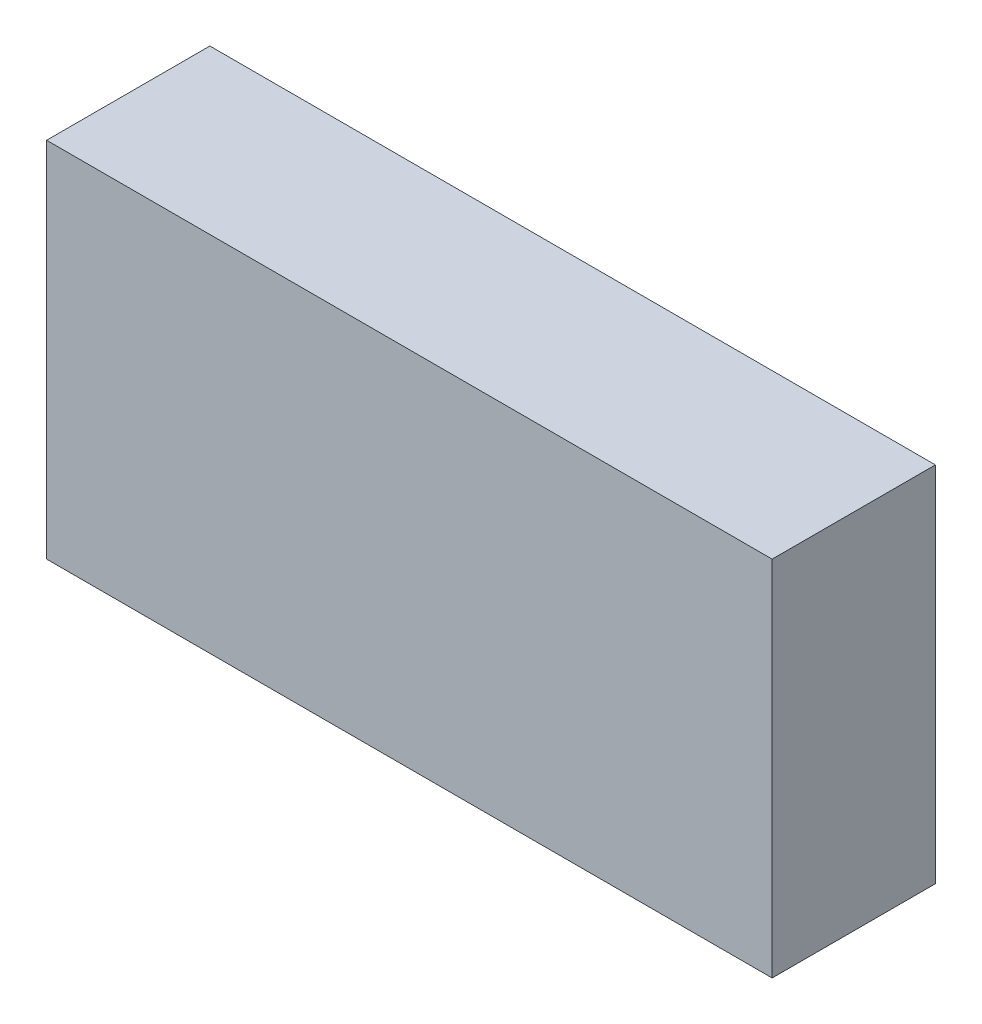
from build123d import *

# Parameters (mm, degrees)
ESQUISSE1_W      = 120
ESQUISSE1_H      = 60
EXTRUSION1_DEPTH = 27


with BuildPart() as part:
    # Esquisse1 → Extrusion1 (new body)
    with BuildSketch(Plane.XY):
        with Locations((60, -30)):
            Rectangle(ESQUISSE1_W, ESQUISSE1_H)
    extrude(amount=EXTRUSION1_DEPTH)


solid = part.part
